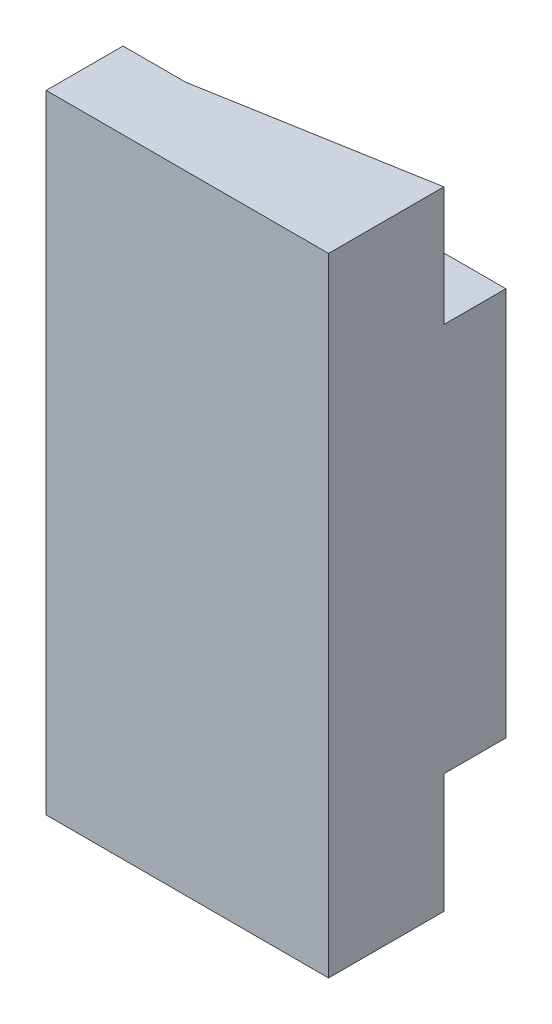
ISO-10303-21;
HEADER;
FILE_DESCRIPTION(('STEP AP214'),'2;1');
FILE_NAME('part.step','',(''),(''),'','','');
FILE_SCHEMA(('AUTOMOTIVE_DESIGN { 1 0 10303 214 1 1 1 1 }'));
ENDSEC;
DATA;
#1=APPLICATION_CONTEXT('core data for automotive mechanical design processes');
#2=APPLICATION_PROTOCOL_DEFINITION('international standard','automotive_design',2000,#1);
#3=PRODUCT_CONTEXT('',#1,'mechanical');
#4=PRODUCT('Part','Part','',(#3));
#5=PRODUCT_RELATED_PRODUCT_CATEGORY('part','',(#4));
#6=PRODUCT_DEFINITION_FORMATION('','',#4);
#7=PRODUCT_DEFINITION_CONTEXT('part definition',#1,'design');
#8=PRODUCT_DEFINITION('design','',#6,#7);
#9=PRODUCT_DEFINITION_SHAPE('','',#8);
#10=(LENGTH_UNIT() NAMED_UNIT(*) SI_UNIT(.MILLI.,.METRE.));
#11=(NAMED_UNIT(*) PLANE_ANGLE_UNIT() SI_UNIT($,.RADIAN.));
#12=(NAMED_UNIT(*) SI_UNIT($,.STERADIAN.) SOLID_ANGLE_UNIT());
#13=UNCERTAINTY_MEASURE_WITH_UNIT(LENGTH_MEASURE(1.E-05),#10,'distance_accuracy_value','');
#14=(GEOMETRIC_REPRESENTATION_CONTEXT(3) GLOBAL_UNCERTAINTY_ASSIGNED_CONTEXT((#13)) GLOBAL_UNIT_ASSIGNED_CONTEXT((#10,
#11,#12)) REPRESENTATION_CONTEXT('',''));
#15=CARTESIAN_POINT('',(0.,0.,0.));
#16=DIRECTION('',(0.,0.,1.));
#17=DIRECTION('',(1.,0.,0.));
#18=AXIS2_PLACEMENT_3D('',#15,#16,#17);
#19=CARTESIAN_POINT('',(3200.,-100.,720.));
#20=DIRECTION('',(0.,0.,-1.));
#21=DIRECTION('',(0.,-1.,0.));
#22=AXIS2_PLACEMENT_3D('',#19,#20,#21);
#23=PLANE('',#22);
#24=DIRECTION('',(0.,1.,0.));
#25=VECTOR('',#24,1.);
#26=CARTESIAN_POINT('',(3200.,-100.,720.));
#27=LINE('',#26,#25);
#28=CARTESIAN_POINT('',(3200.,-620.,720.));
#29=VERTEX_POINT('',#28);
#30=CARTESIAN_POINT('',(3200.,620.,720.));
#31=VERTEX_POINT('',#30);
#32=EDGE_CURVE('E187',#29,#31,#27,.T.);
#33=ORIENTED_EDGE('',*,*,#32,.F.);
#34=DIRECTION('',(0.,-1.,0.));
#35=VECTOR('',#34,1.);
#36=CARTESIAN_POINT('',(3200.,-1100.,720.));
#37=LINE('',#36,#35);
#38=CARTESIAN_POINT('',(3200.,-1000.,720.));
#39=VERTEX_POINT('',#38);
#40=EDGE_CURVE('E154',#29,#39,#37,.T.);
#41=ORIENTED_EDGE('',*,*,#40,.T.);
#42=DIRECTION('',(-1.,0.,0.));
#43=VECTOR('',#42,1.);
#44=CARTESIAN_POINT('',(3200.,-1000.,720.));
#45=LINE('',#44,#43);
#46=CARTESIAN_POINT('',(3000.,-1000.,720.));
#47=VERTEX_POINT('',#46);
#48=EDGE_CURVE('E169',#39,#47,#45,.T.);
#49=ORIENTED_EDGE('',*,*,#48,.T.);
#50=DIRECTION('',(0.,1.,0.));
#51=VECTOR('',#50,1.);
#52=CARTESIAN_POINT('',(3000.,-100.,720.));
#53=LINE('',#52,#51);
#54=CARTESIAN_POINT('',(3000.,1000.,720.));
#55=VERTEX_POINT('',#54);
#56=EDGE_CURVE('E11',#47,#55,#53,.T.);
#57=ORIENTED_EDGE('',*,*,#56,.T.);
#58=DIRECTION('',(-1.,0.,0.));
#59=VECTOR('',#58,1.);
#60=CARTESIAN_POINT('',(3200.,1000.,720.));
#61=LINE('',#60,#59);
#62=CARTESIAN_POINT('',(3200.,1000.,720.));
#63=VERTEX_POINT('',#62);
#64=EDGE_CURVE('E64',#63,#55,#61,.T.);
#65=ORIENTED_EDGE('',*,*,#64,.F.);
#66=DIRECTION('',(0.,1.,0.));
#67=VECTOR('',#66,1.);
#68=CARTESIAN_POINT('',(3200.,1100.,720.));
#69=LINE('',#68,#67);
#70=EDGE_CURVE('E202',#31,#63,#69,.T.);
#71=ORIENTED_EDGE('',*,*,#70,.F.);
#72=EDGE_LOOP('',(#33,#41,#49,#57,#65,#71));
#73=FACE_BOUND('',#72,.T.);
#74=ADVANCED_FACE('F44',(#73),#23,.T.);
#75=CARTESIAN_POINT('',(3000.,0.,0.));
#76=DIRECTION('',(1.,0.,0.));
#77=DIRECTION('',(0.,1.,0.));
#78=AXIS2_PLACEMENT_3D('',#75,#76,#77);
#79=PLANE('',#78);
#80=ORIENTED_EDGE('',*,*,#56,.F.);
#81=DIRECTION('',(0.,0.,-1.));
#82=VECTOR('',#81,1.);
#83=CARTESIAN_POINT('',(3000.,-1000.,965.));
#84=LINE('',#83,#82);
#85=CARTESIAN_POINT('',(3000.,-1000.,965.));
#86=VERTEX_POINT('',#85);
#87=EDGE_CURVE('E168',#86,#47,#84,.T.);
#88=ORIENTED_EDGE('',*,*,#87,.F.);
#89=DIRECTION('',(0.,-1.,0.));
#90=VECTOR('',#89,1.);
#91=CARTESIAN_POINT('',(3000.,-100.,965.));
#92=LINE('',#91,#90);
#93=CARTESIAN_POINT('',(3000.,1000.,965.));
#94=VERTEX_POINT('',#93);
#95=EDGE_CURVE('E192',#94,#86,#92,.T.);
#96=ORIENTED_EDGE('',*,*,#95,.F.);
#97=DIRECTION('',(0.,0.,-1.));
#98=VECTOR('',#97,1.);
#99=CARTESIAN_POINT('',(3000.,1000.,965.));
#100=LINE('',#99,#98);
#101=EDGE_CURVE('E55',#94,#55,#100,.T.);
#102=ORIENTED_EDGE('',*,*,#101,.T.);
#103=EDGE_LOOP('',(#80,#88,#96,#102));
#104=FACE_BOUND('',#103,.T.);
#105=ADVANCED_FACE('F249',(#104),#79,.F.);
#106=CARTESIAN_POINT('',(0.,1000.,0.));
#107=DIRECTION('',(0.,1.,0.));
#108=DIRECTION('',(1.,0.,0.));
#109=AXIS2_PLACEMENT_3D('',#106,#107,#108);
#110=PLANE('',#109);
#111=DIRECTION('',(1.,0.,0.));
#112=VECTOR('',#111,1.);
#113=CARTESIAN_POINT('',(4000.,1000.,965.));
#114=LINE('',#113,#112);
#115=CARTESIAN_POINT('',(3900.,1000.,965.));
#116=VERTEX_POINT('',#115);
#117=EDGE_CURVE('E178',#94,#116,#114,.T.);
#118=ORIENTED_EDGE('',*,*,#117,.T.);
#119=DIRECTION('',(0.,0.,1.));
#120=VECTOR('',#119,1.);
#121=CARTESIAN_POINT('',(3900.,1000.,125.));
#122=LINE('',#121,#120);
#123=CARTESIAN_POINT('',(3900.,1000.,597.50000000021));
#124=VERTEX_POINT('',#123);
#125=EDGE_CURVE('E191',#124,#116,#122,.T.);
#126=ORIENTED_EDGE('',*,*,#125,.F.);
#127=DIRECTION('',(0.985030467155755,0.,-0.172380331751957));
#128=VECTOR('',#127,1.);
#129=CARTESIAN_POINT('',(3200.,1000.,720.));
#130=LINE('',#129,#128);
#131=EDGE_CURVE('E198',#63,#124,#130,.T.);
#132=ORIENTED_EDGE('',*,*,#131,.F.);
#133=ORIENTED_EDGE('',*,*,#64,.T.);
#134=ORIENTED_EDGE('',*,*,#101,.F.);
#135=EDGE_LOOP('',(#118,#126,#132,#133,#134));
#136=FACE_BOUND('',#135,.T.);
#137=ADVANCED_FACE('F244',(#136),#110,.T.);
#138=CARTESIAN_POINT('',(3200.,1100.,720.));
#139=DIRECTION('',(-0.172380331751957,0.,-0.985030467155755));
#140=DIRECTION('',(-0.985030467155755,0.,0.172380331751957));
#141=AXIS2_PLACEMENT_3D('',#138,#139,#140);
#142=PLANE('',#141);
#143=DIRECTION('',(0.,-1.,0.));
#144=VECTOR('',#143,1.);
#145=CARTESIAN_POINT('',(3900.,550.,597.50000000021));
#146=LINE('',#145,#144);
#147=CARTESIAN_POINT('',(3900.,620.,597.50000000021));
#148=VERTEX_POINT('',#147);
#149=EDGE_CURVE('E179',#124,#148,#146,.T.);
#150=ORIENTED_EDGE('',*,*,#149,.T.);
#151=DIRECTION('',(-0.985030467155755,0.,0.172380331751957));
#152=VECTOR('',#151,1.);
#153=CARTESIAN_POINT('',(3200.,620.,720.));
#154=LINE('',#153,#152);
#155=EDGE_CURVE('E86',#148,#31,#154,.T.);
#156=ORIENTED_EDGE('',*,*,#155,.T.);
#157=ORIENTED_EDGE('',*,*,#70,.T.);
#158=ORIENTED_EDGE('',*,*,#131,.T.);
#159=EDGE_LOOP('',(#150,#156,#157,#158));
#160=FACE_BOUND('',#159,.T.);
#161=ADVANCED_FACE('F242',(#160),#142,.T.);
#162=CARTESIAN_POINT('',(3430.,682.,450.));
#163=DIRECTION('',(-0.761243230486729,0.,-0.64846645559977));
#164=DIRECTION('',(-0.64846645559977,0.,0.761243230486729));
#165=AXIS2_PLACEMENT_3D('',#162,#163,#164);
#166=PLANE('',#165);
#167=DIRECTION('',(0.,1.,0.));
#168=VECTOR('',#167,1.);
#169=CARTESIAN_POINT('',(3472.592592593,682.,400.));
#170=LINE('',#169,#168);
#171=CARTESIAN_POINT('',(3472.592592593,-620.,400.));
#172=VERTEX_POINT('',#171);
#173=CARTESIAN_POINT('',(3472.592592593,620.,400.));
#174=VERTEX_POINT('',#173);
#175=EDGE_CURVE('E94',#172,#174,#170,.T.);
#176=ORIENTED_EDGE('',*,*,#175,.F.);
#177=DIRECTION('',(0.64846645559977,0.,-0.76124323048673));
#178=VECTOR('',#177,1.);
#179=CARTESIAN_POINT('',(3430.,-620.,450.));
#180=LINE('',#179,#178);
#181=EDGE_CURVE('E127',#29,#172,#180,.T.);
#182=ORIENTED_EDGE('',*,*,#181,.F.);
#183=ORIENTED_EDGE('',*,*,#32,.T.);
#184=DIRECTION('',(0.64846645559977,0.,-0.76124323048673));
#185=VECTOR('',#184,1.);
#186=CARTESIAN_POINT('',(3430.,620.,450.));
#187=LINE('',#186,#185);
#188=EDGE_CURVE('E129',#31,#174,#187,.T.);
#189=ORIENTED_EDGE('',*,*,#188,.T.);
#190=EDGE_LOOP('',(#176,#182,#183,#189));
#191=FACE_BOUND('',#190,.T.);
#192=ADVANCED_FACE('F125',(#191),#166,.T.);
#193=CARTESIAN_POINT('',(4000.,682.,400.));
#194=DIRECTION('',(0.,0.,-1.));
#195=DIRECTION('',(0.,-1.,0.));
#196=AXIS2_PLACEMENT_3D('',#193,#194,#195);
#197=PLANE('',#196);
#198=DIRECTION('',(0.,-1.,0.));
#199=VECTOR('',#198,1.);
#200=CARTESIAN_POINT('',(3900.,341.,400.));
#201=LINE('',#200,#199);
#202=CARTESIAN_POINT('',(3900.,620.,400.));
#203=VERTEX_POINT('',#202);
#204=CARTESIAN_POINT('',(3900.,-620.,400.));
#205=VERTEX_POINT('',#204);
#206=EDGE_CURVE('E137',#203,#205,#201,.T.);
#207=ORIENTED_EDGE('',*,*,#206,.T.);
#208=DIRECTION('',(1.,0.,0.));
#209=VECTOR('',#208,1.);
#210=CARTESIAN_POINT('',(4000.,-620.,400.));
#211=LINE('',#210,#209);
#212=EDGE_CURVE('E135',#172,#205,#211,.T.);
#213=ORIENTED_EDGE('',*,*,#212,.F.);
#214=ORIENTED_EDGE('',*,*,#175,.T.);
#215=DIRECTION('',(1.,0.,0.));
#216=VECTOR('',#215,1.);
#217=CARTESIAN_POINT('',(4000.,620.,400.));
#218=LINE('',#217,#216);
#219=EDGE_CURVE('E132',#174,#203,#218,.T.);
#220=ORIENTED_EDGE('',*,*,#219,.T.);
#221=EDGE_LOOP('',(#207,#213,#214,#220));
#222=FACE_BOUND('',#221,.T.);
#223=ADVANCED_FACE('F136',(#222),#197,.T.);
#224=CARTESIAN_POINT('',(3900.,0.,125.));
#225=DIRECTION('',(1.,0.,0.));
#226=DIRECTION('',(0.,1.,0.));
#227=AXIS2_PLACEMENT_3D('',#224,#225,#226);
#228=PLANE('',#227);
#229=DIRECTION('',(0.,1.,0.));
#230=VECTOR('',#229,1.);
#231=CARTESIAN_POINT('',(3900.,-50.,965.));
#232=LINE('',#231,#230);
#233=CARTESIAN_POINT('',(3900.,-1000.,965.));
#234=VERTEX_POINT('',#233);
#235=EDGE_CURVE('E188',#234,#116,#232,.T.);
#236=ORIENTED_EDGE('',*,*,#235,.F.);
#237=DIRECTION('',(0.,0.,1.));
#238=VECTOR('',#237,1.);
#239=CARTESIAN_POINT('',(3900.,-1000.,125.));
#240=LINE('',#239,#238);
#241=CARTESIAN_POINT('',(3900.,-1000.,597.50000000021));
#242=VERTEX_POINT('',#241);
#243=EDGE_CURVE('E141',#242,#234,#240,.T.);
#244=ORIENTED_EDGE('',*,*,#243,.F.);
#245=DIRECTION('',(0.,1.,0.));
#246=VECTOR('',#245,1.);
#247=CARTESIAN_POINT('',(3900.,-550.,597.50000000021));
#248=LINE('',#247,#246);
#249=CARTESIAN_POINT('',(3900.,-620.,597.50000000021));
#250=VERTEX_POINT('',#249);
#251=EDGE_CURVE('E158',#242,#250,#248,.T.);
#252=ORIENTED_EDGE('',*,*,#251,.T.);
#253=DIRECTION('',(0.,0.,-1.));
#254=VECTOR('',#253,1.);
#255=CARTESIAN_POINT('',(3900.,-620.,62.5));
#256=LINE('',#255,#254);
#257=EDGE_CURVE('E162',#250,#205,#256,.T.);
#258=ORIENTED_EDGE('',*,*,#257,.T.);
#259=ORIENTED_EDGE('',*,*,#206,.F.);
#260=DIRECTION('',(0.,0.,-1.));
#261=VECTOR('',#260,1.);
#262=CARTESIAN_POINT('',(3900.,620.,62.5));
#263=LINE('',#262,#261);
#264=EDGE_CURVE('E48',#148,#203,#263,.T.);
#265=ORIENTED_EDGE('',*,*,#264,.F.);
#266=ORIENTED_EDGE('',*,*,#149,.F.);
#267=ORIENTED_EDGE('',*,*,#125,.T.);
#268=EDGE_LOOP('',(#236,#244,#252,#258,#259,#265,#266,#267));
#269=FACE_BOUND('',#268,.T.);
#270=ADVANCED_FACE('F237',(#269),#228,.T.);
#271=CARTESIAN_POINT('',(4000.,-100.,965.));
#272=DIRECTION('',(0.,0.,1.));
#273=DIRECTION('',(1.,0.,0.));
#274=AXIS2_PLACEMENT_3D('',#271,#272,#273);
#275=PLANE('',#274);
#276=ORIENTED_EDGE('',*,*,#95,.T.);
#277=DIRECTION('',(1.,0.,0.));
#278=VECTOR('',#277,1.);
#279=CARTESIAN_POINT('',(4000.,-1000.,965.));
#280=LINE('',#279,#278);
#281=EDGE_CURVE('E164',#86,#234,#280,.T.);
#282=ORIENTED_EDGE('',*,*,#281,.T.);
#283=ORIENTED_EDGE('',*,*,#235,.T.);
#284=ORIENTED_EDGE('',*,*,#117,.F.);
#285=EDGE_LOOP('',(#276,#282,#283,#284));
#286=FACE_BOUND('',#285,.T.);
#287=ADVANCED_FACE('F246',(#286),#275,.T.);
#288=CARTESIAN_POINT('',(0.,620.,0.));
#289=DIRECTION('',(0.,1.,0.));
#290=DIRECTION('',(1.,0.,0.));
#291=AXIS2_PLACEMENT_3D('',#288,#289,#290);
#292=PLANE('',#291);
#293=ORIENTED_EDGE('',*,*,#155,.F.);
#294=ORIENTED_EDGE('',*,*,#264,.T.);
#295=ORIENTED_EDGE('',*,*,#219,.F.);
#296=ORIENTED_EDGE('',*,*,#188,.F.);
#297=EDGE_LOOP('',(#293,#294,#295,#296));
#298=FACE_BOUND('',#297,.T.);
#299=ADVANCED_FACE('F46',(#298),#292,.T.);
#300=CARTESIAN_POINT('',(0.,-1000.,0.));
#301=DIRECTION('',(0.,-1.,0.));
#302=DIRECTION('',(1.,0.,0.));
#303=AXIS2_PLACEMENT_3D('',#300,#301,#302);
#304=PLANE('',#303);
#305=ORIENTED_EDGE('',*,*,#281,.F.);
#306=ORIENTED_EDGE('',*,*,#87,.T.);
#307=ORIENTED_EDGE('',*,*,#48,.F.);
#308=DIRECTION('',(0.985030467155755,0.,-0.172380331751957));
#309=VECTOR('',#308,1.);
#310=CARTESIAN_POINT('',(3200.,-1000.,720.));
#311=LINE('',#310,#309);
#312=EDGE_CURVE('E148',#39,#242,#311,.T.);
#313=ORIENTED_EDGE('',*,*,#312,.T.);
#314=ORIENTED_EDGE('',*,*,#243,.T.);
#315=EDGE_LOOP('',(#305,#306,#307,#313,#314));
#316=FACE_BOUND('',#315,.T.);
#317=ADVANCED_FACE('F247',(#316),#304,.T.);
#318=CARTESIAN_POINT('',(3200.,-1100.,720.));
#319=DIRECTION('',(-0.172380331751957,0.,-0.985030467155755));
#320=DIRECTION('',(-0.985030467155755,0.,0.172380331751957));
#321=AXIS2_PLACEMENT_3D('',#318,#319,#320);
#322=PLANE('',#321);
#323=ORIENTED_EDGE('',*,*,#251,.F.);
#324=ORIENTED_EDGE('',*,*,#312,.F.);
#325=ORIENTED_EDGE('',*,*,#40,.F.);
#326=DIRECTION('',(-0.985030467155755,0.,0.172380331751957));
#327=VECTOR('',#326,1.);
#328=CARTESIAN_POINT('',(3200.,-620.,720.));
#329=LINE('',#328,#327);
#330=EDGE_CURVE('E145',#250,#29,#329,.T.);
#331=ORIENTED_EDGE('',*,*,#330,.F.);
#332=EDGE_LOOP('',(#323,#324,#325,#331));
#333=FACE_BOUND('',#332,.T.);
#334=ADVANCED_FACE('F239',(#333),#322,.T.);
#335=CARTESIAN_POINT('',(0.,-620.,0.));
#336=DIRECTION('',(0.,-1.,0.));
#337=DIRECTION('',(1.,0.,0.));
#338=AXIS2_PLACEMENT_3D('',#335,#336,#337);
#339=PLANE('',#338);
#340=ORIENTED_EDGE('',*,*,#330,.T.);
#341=ORIENTED_EDGE('',*,*,#181,.T.);
#342=ORIENTED_EDGE('',*,*,#212,.T.);
#343=ORIENTED_EDGE('',*,*,#257,.F.);
#344=EDGE_LOOP('',(#340,#341,#342,#343));
#345=FACE_BOUND('',#344,.T.);
#346=ADVANCED_FACE('F143',(#345),#339,.T.);
#347=CLOSED_SHELL('',(#74,#105,#137,#161,#192,#223,#270,#287,#299,#317,#334,#346));
#348=MANIFOLD_SOLID_BREP('B2',#347);
#349=ADVANCED_BREP_SHAPE_REPRESENTATION('',(#18,#348),#14);
#350=SHAPE_DEFINITION_REPRESENTATION(#9,#349);
ENDSEC;
END-ISO-10303-21;
